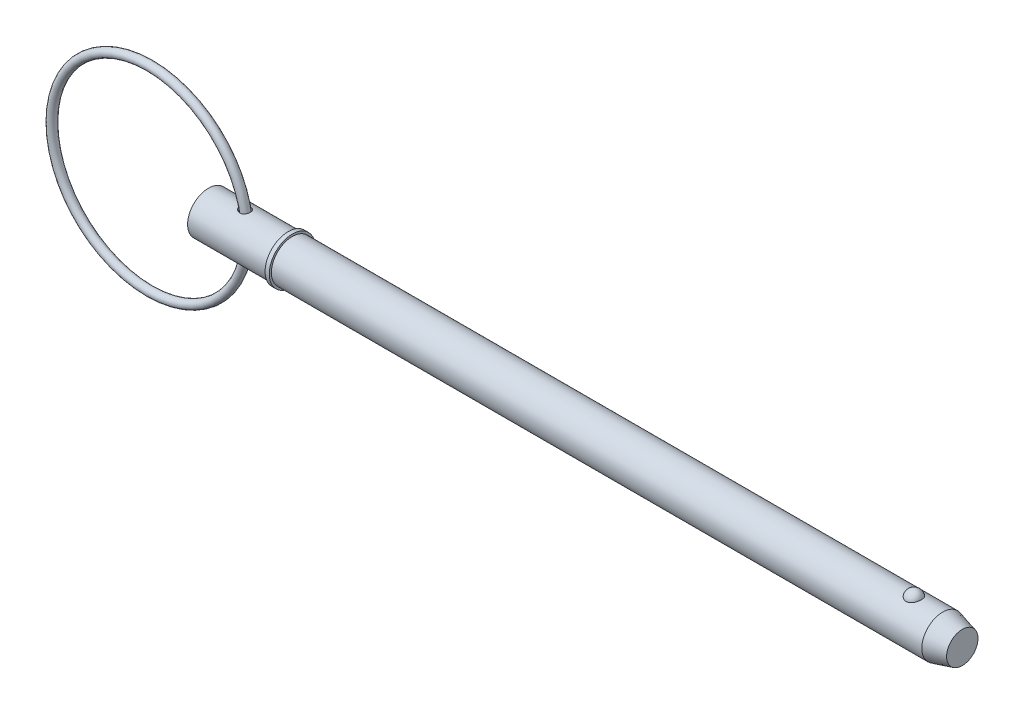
ISO-10303-21;
HEADER;
FILE_DESCRIPTION(('STEP AP214'),'2;1');
FILE_NAME('part.step','',(''),(''),'','','');
FILE_SCHEMA(('AUTOMOTIVE_DESIGN { 1 0 10303 214 1 1 1 1 }'));
ENDSEC;
DATA;
#1=APPLICATION_CONTEXT('core data for automotive mechanical design processes');
#2=APPLICATION_PROTOCOL_DEFINITION('international standard','automotive_design',2000,#1);
#3=PRODUCT_CONTEXT('',#1,'mechanical');
#4=PRODUCT('Part','Part','',(#3));
#5=PRODUCT_RELATED_PRODUCT_CATEGORY('part','',(#4));
#6=PRODUCT_DEFINITION_FORMATION('','',#4);
#7=PRODUCT_DEFINITION_CONTEXT('part definition',#1,'design');
#8=PRODUCT_DEFINITION('design','',#6,#7);
#9=PRODUCT_DEFINITION_SHAPE('','',#8);
#10=(LENGTH_UNIT() NAMED_UNIT(*) SI_UNIT(.MILLI.,.METRE.));
#11=(NAMED_UNIT(*) PLANE_ANGLE_UNIT() SI_UNIT($,.RADIAN.));
#12=(NAMED_UNIT(*) SI_UNIT($,.STERADIAN.) SOLID_ANGLE_UNIT());
#13=UNCERTAINTY_MEASURE_WITH_UNIT(LENGTH_MEASURE(1.E-05),#10,'distance_accuracy_value','');
#14=(GEOMETRIC_REPRESENTATION_CONTEXT(3) GLOBAL_UNCERTAINTY_ASSIGNED_CONTEXT((#13)) GLOBAL_UNIT_ASSIGNED_CONTEXT((#10,
#11,#12)) REPRESENTATION_CONTEXT('',''));
#15=CARTESIAN_POINT('',(0.,0.,0.));
#16=DIRECTION('',(0.,0.,1.));
#17=DIRECTION('',(1.,0.,0.));
#18=AXIS2_PLACEMENT_3D('',#15,#16,#17);
#19=CARTESIAN_POINT('',(-13.4013067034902,0.,0.));
#20=DIRECTION('',(0.,0.,1.));
#21=DIRECTION('',(1.,0.,0.));
#22=AXIS2_PLACEMENT_3D('',#19,#20,#21);
#23=TOROIDAL_SURFACE('',#22,22.225,0.952999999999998);
#24=CARTESIAN_POINT('',(9.77669329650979,0.,0.));
#25=VERTEX_POINT('',#24);
#26=VERTEX_LOOP('',#25);
#27=FACE_BOUND('',#26,.T.);
#28=ADVANCED_FACE('P0_F12',(#27),#23,.T.);
#29=CLOSED_SHELL('',(#28));
#30=MANIFOLD_SOLID_BREP('P0_B1',#29);
#31=CARTESIAN_POINT('',(0.,0.,0.));
#32=DIRECTION('',(1.,0.,0.));
#33=DIRECTION('',(0.,0.,-1.));
#34=AXIS2_PLACEMENT_3D('',#31,#32,#33);
#35=CYLINDRICAL_SURFACE('',#34,4.765);
#36=CARTESIAN_POINT('',(7.31773584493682,4.71580709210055,-0.682926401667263));
#37=CARTESIAN_POINT('',(7.3607471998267,4.70750812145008,-0.740230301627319));
#38=CARTESIAN_POINT('',(7.40883112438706,4.69869300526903,-0.79371122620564));
#39=CARTESIAN_POINT('',(7.51340999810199,4.68106981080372,-0.89180043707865));
#40=CARTESIAN_POINT('',(7.56991882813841,4.67226176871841,-0.936393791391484));
#41=CARTESIAN_POINT('',(7.689548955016,4.65568581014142,-1.01560363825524));
#42=CARTESIAN_POINT('',(7.75265928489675,4.64791621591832,-1.05023633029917));
#43=CARTESIAN_POINT('',(7.88387110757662,4.6343185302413,-1.10870278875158));
#44=CARTESIAN_POINT('',(7.95197058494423,4.62848966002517,-1.13254088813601));
#45=CARTESIAN_POINT('',(8.09209413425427,4.6194749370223,-1.16877415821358));
#46=CARTESIAN_POINT('',(8.16415141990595,4.6163169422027,-1.18104886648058));
#47=CARTESIAN_POINT('',(8.30937958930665,4.61324608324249,-1.19299123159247));
#48=CARTESIAN_POINT('',(8.38255011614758,4.61333220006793,-1.19266284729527));
#49=CARTESIAN_POINT('',(8.52374186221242,4.61674026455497,-1.17939593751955));
#50=CARTESIAN_POINT('',(8.59183022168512,4.61989017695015,-1.16712781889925));
#51=CARTESIAN_POINT('',(8.72470143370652,4.62884731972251,-1.13107903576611));
#52=CARTESIAN_POINT('',(8.78948513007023,4.63465386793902,-1.10730132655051));
#53=CARTESIAN_POINT('',(8.91088768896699,4.64792402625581,-1.05016249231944));
#54=CARTESIAN_POINT('',(8.96774302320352,4.65530108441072,-1.01728198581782));
#55=CARTESIAN_POINT('',(9.07499804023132,4.67102002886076,-0.942471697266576));
#56=CARTESIAN_POINT('',(9.12539777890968,4.6793619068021,-0.900541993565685));
#57=CARTESIAN_POINT('',(9.21836221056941,4.69607497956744,-0.808868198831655));
#58=CARTESIAN_POINT('',(9.26093651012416,4.70444612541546,-0.759133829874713));
#59=CARTESIAN_POINT('',(9.33728390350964,4.72032100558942,-0.653192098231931));
#60=CARTESIAN_POINT('',(9.3710564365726,4.72782468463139,-0.596984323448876));
#61=CARTESIAN_POINT('',(9.42940600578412,4.74126034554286,-0.478808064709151));
#62=CARTESIAN_POINT('',(9.45384681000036,4.74716869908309,-0.416769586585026));
#63=CARTESIAN_POINT('',(9.49226260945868,4.75663465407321,-0.289362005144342));
#64=CARTESIAN_POINT('',(9.50623742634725,4.76019221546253,-0.22399284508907));
#65=CARTESIAN_POINT('',(9.52342004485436,4.76458450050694,-0.0914886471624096));
#66=CARTESIAN_POINT('',(9.52658321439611,4.7654079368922,-0.0243474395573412));
#67=CARTESIAN_POINT('',(9.52194012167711,4.76421136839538,0.109528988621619));
#68=CARTESIAN_POINT('',(9.51413380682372,4.7621913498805,0.176264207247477));
#69=CARTESIAN_POINT('',(9.48775485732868,4.75552896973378,0.307367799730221));
#70=CARTESIAN_POINT('',(9.4691926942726,4.75088915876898,0.371738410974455));
#71=CARTESIAN_POINT('',(9.42175836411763,4.73949008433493,0.496364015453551));
#72=CARTESIAN_POINT('',(9.39288586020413,4.73273075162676,0.556618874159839));
#73=CARTESIAN_POINT('',(9.32549385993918,4.71782154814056,0.671371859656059));
#74=CARTESIAN_POINT('',(9.28696367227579,4.70967013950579,0.725863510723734));
#75=CARTESIAN_POINT('',(9.20123305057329,4.6928883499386,0.827453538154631));
#76=CARTESIAN_POINT('',(9.15403300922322,4.68425799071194,0.874552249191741));
#77=CARTESIAN_POINT('',(9.05250467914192,4.66754854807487,0.959736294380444));
#78=CARTESIAN_POINT('',(8.99822095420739,4.65946646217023,0.997874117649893));
#79=CARTESIAN_POINT('',(8.88381123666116,4.64472049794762,1.06440739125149));
#80=CARTESIAN_POINT('',(8.82368614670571,4.63805640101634,1.09280434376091));
#81=CARTESIAN_POINT('',(8.70022952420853,4.62698068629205,1.13878427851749));
#82=CARTESIAN_POINT('',(8.63695594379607,4.62253830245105,1.15651569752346));
#83=CARTESIAN_POINT('',(8.50825296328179,4.61622454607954,1.18146656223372));
#84=CARTESIAN_POINT('',(8.44282353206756,4.61435321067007,1.18868585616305));
#85=CARTESIAN_POINT('',(8.31119087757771,4.61332122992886,1.19268442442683));
#86=CARTESIAN_POINT('',(8.24498542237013,4.61417920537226,1.18939198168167));
#87=CARTESIAN_POINT('',(8.11397487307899,4.61847671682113,1.17259121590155));
#88=CARTESIAN_POINT('',(8.04917011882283,4.62191687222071,1.15908044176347));
#89=CARTESIAN_POINT('',(7.91946226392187,4.63117528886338,1.12153047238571));
#90=CARTESIAN_POINT('',(7.85470460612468,4.6371000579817,1.09701575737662));
#91=CARTESIAN_POINT('',(7.7300035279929,4.65063246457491,1.03814807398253));
#92=CARTESIAN_POINT('',(7.67006197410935,4.65824075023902,1.00379131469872));
#93=CARTESIAN_POINT('',(7.55352765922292,4.67473656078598,0.924015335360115));
#94=CARTESIAN_POINT('',(7.49726947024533,4.68366994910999,0.878115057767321));
#95=CARTESIAN_POINT('',(7.39344083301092,4.70144936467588,0.777311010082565));
#96=CARTESIAN_POINT('',(7.34587087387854,4.71029538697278,0.722406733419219));
#97=CARTESIAN_POINT('',(7.26188955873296,4.72669773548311,0.605773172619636));
#98=CARTESIAN_POINT('',(7.22531316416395,4.73427229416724,0.544165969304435));
#99=CARTESIAN_POINT('',(7.16406269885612,4.74732663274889,0.415095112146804));
#100=CARTESIAN_POINT('',(7.13937848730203,4.75280819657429,0.347636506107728));
#101=CARTESIAN_POINT('',(7.10494917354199,4.7605495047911,0.215359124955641));
#102=CARTESIAN_POINT('',(7.09405441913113,4.76305589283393,0.150853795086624));
#103=CARTESIAN_POINT('',(7.08387189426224,4.76539656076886,0.0208839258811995));
#104=CARTESIAN_POINT('',(7.0845805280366,4.76523166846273,-0.0445803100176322));
#105=CARTESIAN_POINT('',(7.09709111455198,4.76236014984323,-0.169693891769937));
#106=CARTESIAN_POINT('',(7.10810913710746,4.75983315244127,-0.229428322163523));
#107=CARTESIAN_POINT('',(7.13959099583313,4.75276726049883,-0.346187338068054));
#108=CARTESIAN_POINT('',(7.16004881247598,4.7482296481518,-0.403213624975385));
#109=CARTESIAN_POINT('',(7.20270325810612,4.73907067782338,-0.498040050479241));
#110=CARTESIAN_POINT('',(7.22286864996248,4.73481668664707,-0.536809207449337));
#111=CARTESIAN_POINT('',(7.26730952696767,4.72570777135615,-0.611832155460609));
#112=CARTESIAN_POINT('',(7.29158512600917,4.72085283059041,-0.64808587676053));
#113=CARTESIAN_POINT('',(7.31773584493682,4.71580709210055,-0.682926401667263));
#114=B_SPLINE_CURVE_WITH_KNOTS('',3,(#36,#37,#38,#39,#40,#41,#42,#43,#44,#45,#46,#47,#48,#49,
#50,#51,#52,#53,#54,#55,#56,#57,#58,#59,#60,#61,#62,#63,#64,#65,#66,#67,#68,#69,#70,#71,#72,#73,
#74,#75,#76,#77,#78,#79,#80,#81,#82,#83,#84,#85,#86,#87,#88,#89,#90,#91,#92,#93,#94,#95,#96,#97,
#98,#99,#100,#101,#102,#103,#104,#105,#106,#107,#108,#109,#110,#111,#112,#113),.UNSPECIFIED.,
.T.,.F.,(4,2,2,2,2,2,2,2,2,2,2,2,2,2,2,2,2,2,2,2,2,2,2,2,2,2,2,2,2,2,2,2,2,2,2,2,2,2,4),(0.,
0.216219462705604,0.432799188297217,0.649024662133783,0.865163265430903,1.08352938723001,
1.30182691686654,1.50853487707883,1.71518978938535,1.91252381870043,2.1098561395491,
2.30694457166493,2.50404555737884,2.70392296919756,2.90380378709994,3.10450875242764,
3.30521468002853,3.5057255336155,3.70624293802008,3.90698330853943,4.10771458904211,
4.30723900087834,4.50673262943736,4.70338139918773,4.90003300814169,5.09802914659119,
5.29607279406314,5.5036500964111,5.7113074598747,5.92972727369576,6.14815938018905,
6.36312650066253,6.57790998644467,6.77325899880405,6.96854747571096,7.15009726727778,
7.33153144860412,7.46298830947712,7.59444881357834),.UNSPECIFIED.);
#115=CARTESIAN_POINT('',(7.31773584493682,4.71580709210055,-0.682926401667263));
#116=VERTEX_POINT('',#115);
#117=EDGE_CURVE('P1_E42',#116,#116,#114,.T.);
#118=ORIENTED_EDGE('',*,*,#117,.T.);
#119=EDGE_LOOP('',(#118));
#120=FACE_BOUND('',#119,.T.);
#121=CARTESIAN_POINT('',(0.,0.,0.));
#122=DIRECTION('',(1.,0.,0.));
#123=DIRECTION('',(0.,0.,-1.));
#124=AXIS2_PLACEMENT_3D('',#121,#122,#123);
#125=CIRCLE('',#124,4.765);
#126=CARTESIAN_POINT('',(0.,0.,-4.765));
#127=VERTEX_POINT('',#126);
#128=EDGE_CURVE('P1_E9',#127,#127,#125,.T.);
#129=ORIENTED_EDGE('',*,*,#128,.T.);
#130=EDGE_LOOP('',(#129));
#131=FACE_BOUND('',#130,.T.);
#132=CARTESIAN_POINT('',(18.097,0.,0.));
#133=DIRECTION('',(1.,0.,0.));
#134=DIRECTION('',(0.,0.,-1.));
#135=AXIS2_PLACEMENT_3D('',#132,#133,#134);
#136=CIRCLE('',#135,4.765);
#137=CARTESIAN_POINT('',(18.097,0.,-4.765));
#138=VERTEX_POINT('',#137);
#139=EDGE_CURVE('P1_E25',#138,#138,#136,.T.);
#140=ORIENTED_EDGE('',*,*,#139,.F.);
#141=EDGE_LOOP('',(#140));
#142=FACE_BOUND('',#141,.T.);
#143=CARTESIAN_POINT('',(7.31773584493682,-4.71580709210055,-0.682926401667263));
#144=CARTESIAN_POINT('',(7.27956054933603,-4.72317282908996,-0.63206220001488));
#145=CARTESIAN_POINT('',(7.24535712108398,-4.7301361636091,-0.578155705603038));
#146=CARTESIAN_POINT('',(7.18611785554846,-4.74256090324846,-0.465352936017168));
#147=CARTESIAN_POINT('',(7.16107836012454,-4.74802290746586,-0.406458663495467));
#148=CARTESIAN_POINT('',(7.12119149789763,-4.75686558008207,-0.284913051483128));
#149=CARTESIAN_POINT('',(7.1063796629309,-4.76023898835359,-0.222249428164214));
#150=CARTESIAN_POINT('',(7.08786546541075,-4.76447177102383,-0.0952170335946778));
#151=CARTESIAN_POINT('',(7.08416018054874,-4.76533180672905,-0.0308487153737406));
#152=CARTESIAN_POINT('',(7.08795686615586,-4.76445764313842,0.0942755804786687));
#153=CARTESIAN_POINT('',(7.09490366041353,-4.762851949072,0.155050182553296));
#154=CARTESIAN_POINT('',(7.11863973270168,-4.75746086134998,0.2745356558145));
#155=CARTESIAN_POINT('',(7.13542953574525,-4.75367535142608,0.333246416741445));
#156=CARTESIAN_POINT('',(7.17817193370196,-4.74430545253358,0.447305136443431));
#157=CARTESIAN_POINT('',(7.20415836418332,-4.73871442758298,0.502639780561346));
#158=CARTESIAN_POINT('',(7.26428068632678,-4.72628508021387,0.608523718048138));
#159=CARTESIAN_POINT('',(7.29841897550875,-4.71944639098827,0.659071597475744));
#160=CARTESIAN_POINT('',(7.37680984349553,-4.70456239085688,0.758311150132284));
#161=CARTESIAN_POINT('',(7.42165519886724,-4.69646426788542,0.806526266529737));
#162=CARTESIAN_POINT('',(7.51828933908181,-4.68032890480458,0.895428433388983));
#163=CARTESIAN_POINT('',(7.57008134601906,-4.67229169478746,0.936111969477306));
#164=CARTESIAN_POINT('',(7.68397204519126,-4.65640659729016,1.01229731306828));
#165=CARTESIAN_POINT('',(7.74657226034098,-4.64863251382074,1.04706751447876));
#166=CARTESIAN_POINT('',(7.87680110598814,-4.6349740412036,1.10596507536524));
#167=CARTESIAN_POINT('',(7.94443054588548,-4.62908995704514,1.13009071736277));
#168=CARTESIAN_POINT('',(8.08402017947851,-4.61989019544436,1.16713943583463));
#169=CARTESIAN_POINT('',(8.15603143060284,-4.61661596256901,1.17988211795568));
#170=CARTESIAN_POINT('',(8.30124697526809,-4.61330446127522,1.1927680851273));
#171=CARTESIAN_POINT('',(8.37445077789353,-4.61326589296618,1.19291642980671));
#172=CARTESIAN_POINT('',(8.51584800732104,-4.61644036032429,1.18056687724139));
#173=CARTESIAN_POINT('',(8.58410302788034,-4.61948317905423,1.16873099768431));
#174=CARTESIAN_POINT('',(8.71738052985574,-4.6282520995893,1.13350536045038));
#175=CARTESIAN_POINT('',(8.78240382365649,-4.63397752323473,1.11011852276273));
#176=CARTESIAN_POINT('',(8.90428519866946,-4.64711877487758,1.05371003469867));
#177=CARTESIAN_POINT('',(8.96138096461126,-4.6544450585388,1.02117932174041));
#178=CARTESIAN_POINT('',(9.06916653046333,-4.6700970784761,0.947021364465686));
#179=CARTESIAN_POINT('',(9.11985639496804,-4.67842280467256,0.905394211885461));
#180=CARTESIAN_POINT('',(9.2134071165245,-4.69513303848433,0.814300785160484));
#181=CARTESIAN_POINT('',(9.25628268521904,-4.70351740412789,0.764849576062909));
#182=CARTESIAN_POINT('',(9.33327173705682,-4.71945185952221,0.659422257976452));
#183=CARTESIAN_POINT('',(9.3673846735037,-4.72700189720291,0.603445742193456));
#184=CARTESIAN_POINT('',(9.42645214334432,-4.74055953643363,0.485673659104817));
#185=CARTESIAN_POINT('',(9.45127042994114,-4.74654383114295,0.423807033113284));
#186=CARTESIAN_POINT('',(9.49046298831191,-4.756182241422,0.296676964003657));
#187=CARTESIAN_POINT('',(9.50483706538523,-4.75983631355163,0.231413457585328));
#188=CARTESIAN_POINT('',(9.52283408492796,-4.76443282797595,0.0990368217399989));
#189=CARTESIAN_POINT('',(9.52641016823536,-4.76536345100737,0.0319169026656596));
#190=CARTESIAN_POINT('',(9.52259067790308,-4.76437893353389,-0.101988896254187));
#191=CARTESIAN_POINT('',(9.5151950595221,-4.76246378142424,-0.168774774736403));
#192=CARTESIAN_POINT('',(9.48962516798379,-4.75599746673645,-0.300048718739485));
#193=CARTESIAN_POINT('',(9.4714615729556,-4.75144891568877,-0.364538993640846));
#194=CARTESIAN_POINT('',(9.42480303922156,-4.74020887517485,-0.489470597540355));
#195=CARTESIAN_POINT('',(9.396307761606,-4.73351731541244,-0.549911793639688));
#196=CARTESIAN_POINT('',(9.32963953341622,-4.71871240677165,-0.665099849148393));
#197=CARTESIAN_POINT('',(9.29145577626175,-4.71059747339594,-0.719840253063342));
#198=CARTESIAN_POINT('',(9.20637695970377,-4.69385254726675,-0.82198328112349));
#199=CARTESIAN_POINT('',(9.15948227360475,-4.68522257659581,-0.869386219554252));
#200=CARTESIAN_POINT('',(9.05849937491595,-4.66847516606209,-0.955233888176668));
#201=CARTESIAN_POINT('',(9.00445430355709,-4.6603550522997,-0.993728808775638));
#202=CARTESIAN_POINT('',(8.8904576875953,-4.64550122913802,-1.06100691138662));
#203=CARTESIAN_POINT('',(8.83050704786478,-4.63876730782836,-1.08979157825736));
#204=CARTESIAN_POINT('',(8.70732873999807,-4.6275305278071,-1.13655620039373));
#205=CARTESIAN_POINT('',(8.64416019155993,-4.62299714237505,-1.15468477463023));
#206=CARTESIAN_POINT('',(8.51559711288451,-4.61649071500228,-1.18043067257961));
#207=CARTESIAN_POINT('',(8.4502025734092,-4.61451768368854,-1.18804795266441));
#208=CARTESIAN_POINT('',(8.31862013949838,-4.61328355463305,-1.19283094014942));
#209=CARTESIAN_POINT('',(8.25242983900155,-4.61403911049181,-1.18993246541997));
#210=CARTESIAN_POINT('',(8.12138461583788,-4.61814057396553,-1.17391149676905));
#211=CARTESIAN_POINT('',(8.0565300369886,-4.62148714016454,-1.16078640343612));
#212=CARTESIAN_POINT('',(7.92669960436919,-4.63056912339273,-1.12402333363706));
#213=CARTESIAN_POINT('',(7.86186447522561,-4.63641051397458,-1.09991536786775));
#214=CARTESIAN_POINT('',(7.73694230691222,-4.64980121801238,-1.04185298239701));
#215=CARTESIAN_POINT('',(7.6768568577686,-4.65735110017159,-1.0078952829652));
#216=CARTESIAN_POINT('',(7.56207884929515,-4.67346080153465,-0.930364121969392));
#217=CARTESIAN_POINT('',(7.5074784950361,-4.68203382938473,-0.886656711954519));
#218=CARTESIAN_POINT('',(7.40624045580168,-4.69916824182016,-0.79082583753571));
#219=CARTESIAN_POINT('',(7.35959988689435,-4.7077296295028,-0.738705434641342));
#220=CARTESIAN_POINT('',(7.31773584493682,-4.71580709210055,-0.682926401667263));
#221=B_SPLINE_CURVE_WITH_KNOTS('',3,(#143,#144,#145,#146,#147,#148,#149,#150,#151,#152,#153,
#154,#155,#156,#157,#158,#159,#160,#161,#162,#163,#164,#165,#166,#167,#168,#169,#170,#171,#172,
#173,#174,#175,#176,#177,#178,#179,#180,#181,#182,#183,#184,#185,#186,#187,#188,#189,#190,#191,
#192,#193,#194,#195,#196,#197,#198,#199,#200,#201,#202,#203,#204,#205,#206,#207,#208,#209,#210,
#211,#212,#213,#214,#215,#216,#217,#218,#219,#220),.UNSPECIFIED.,.T.,.F.,(4,2,2,2,2,2,2,2,2,2,2,
2,2,2,2,2,2,2,2,2,2,2,2,2,2,2,2,2,2,2,2,2,2,2,2,2,2,2,4),(0.,0.191851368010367,0.38362606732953,
0.576063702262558,0.768450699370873,0.951145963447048,1.13385097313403,1.31723528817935,
1.50067360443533,1.69887079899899,1.8971602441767,2.11225870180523,2.32739185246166,
2.54587681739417,2.76427400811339,2.97123130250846,3.17813630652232,3.37555441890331,
3.57297054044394,3.77001106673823,3.96706388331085,4.16690159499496,4.36674303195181,
4.56745046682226,4.76815872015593,4.96866827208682,5.16918440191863,5.36992517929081,
5.5706573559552,5.77022940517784,5.96977092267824,6.16645904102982,6.36314797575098,
6.56103940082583,6.75898114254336,6.96633026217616,7.17374850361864,7.384214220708,
7.59460352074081),.UNSPECIFIED.);
#222=CARTESIAN_POINT('',(7.31773584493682,-4.71580709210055,-0.682926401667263));
#223=VERTEX_POINT('',#222);
#224=EDGE_CURVE('P1_E17',#223,#223,#221,.T.);
#225=ORIENTED_EDGE('',*,*,#224,.T.);
#226=EDGE_LOOP('',(#225));
#227=FACE_BOUND('',#226,.T.);
#228=ADVANCED_FACE('P1_F13',(#120,#131,#142,#227),#35,.T.);
#229=CARTESIAN_POINT('',(0.,0.,0.));
#230=DIRECTION('',(1.,0.,0.));
#231=DIRECTION('',(0.,0.,-1.));
#232=AXIS2_PLACEMENT_3D('',#229,#230,#231);
#233=CYLINDRICAL_SURFACE('',#232,4.765);
#234=CARTESIAN_POINT('',(167.004194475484,0.,0.));
#235=DIRECTION('',(1.,0.,0.));
#236=DIRECTION('',(0.,0.,-1.));
#237=AXIS2_PLACEMENT_3D('',#234,#235,#236);
#238=CIRCLE('',#237,4.765);
#239=CARTESIAN_POINT('',(167.004194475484,0.,-4.765));
#240=VERTEX_POINT('',#239);
#241=EDGE_CURVE('P1_E99',#240,#240,#238,.T.);
#242=ORIENTED_EDGE('',*,*,#241,.F.);
#243=EDGE_LOOP('',(#242));
#244=FACE_BOUND('',#243,.T.);
#245=CARTESIAN_POINT('',(19.05,0.,0.));
#246=DIRECTION('',(1.,0.,0.));
#247=DIRECTION('',(0.,0.,-1.));
#248=AXIS2_PLACEMENT_3D('',#245,#246,#247);
#249=CIRCLE('',#248,4.765);
#250=CARTESIAN_POINT('',(19.05,0.,-4.765));
#251=VERTEX_POINT('',#250);
#252=EDGE_CURVE('P1_E96',#251,#251,#249,.T.);
#253=ORIENTED_EDGE('',*,*,#252,.T.);
#254=EDGE_LOOP('',(#253));
#255=FACE_BOUND('',#254,.T.);
#256=CARTESIAN_POINT('',(160.451020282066,4.42764777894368,1.76101111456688));
#257=CARTESIAN_POINT('',(160.359721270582,4.42764470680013,1.76101422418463));
#258=CARTESIAN_POINT('',(160.268446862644,4.43059091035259,1.75366340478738));
#259=CARTESIAN_POINT('',(160.088615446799,4.44201846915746,1.72451180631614));
#260=CARTESIAN_POINT('',(160.000057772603,4.45049845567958,1.70271460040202));
#261=CARTESIAN_POINT('',(159.828257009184,4.47200516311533,1.64539370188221));
#262=CARTESIAN_POINT('',(159.745006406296,4.48502527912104,1.60988994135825));
#263=CARTESIAN_POINT('',(159.585763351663,4.51419542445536,1.52617873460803));
#264=CARTESIAN_POINT('',(159.509772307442,4.53034605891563,1.47796883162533));
#265=CARTESIAN_POINT('',(159.364744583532,4.56459317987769,1.36860494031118));
#266=CARTESIAN_POINT('',(159.295964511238,4.58273170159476,1.30712420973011));
#267=CARTESIAN_POINT('',(159.169342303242,4.61870302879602,1.17370204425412));
#268=CARTESIAN_POINT('',(159.111502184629,4.63653577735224,1.10175868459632));
#269=CARTESIAN_POINT('',(159.005570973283,4.67090140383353,0.945806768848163));
#270=CARTESIAN_POINT('',(158.958030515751,4.68734068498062,0.861402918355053));
#271=CARTESIAN_POINT('',(158.877081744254,4.71628466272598,0.68544236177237));
#272=CARTESIAN_POINT('',(158.843674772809,4.72878898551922,0.593884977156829));
#273=CARTESIAN_POINT('',(158.791287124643,4.74874061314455,0.404781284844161));
#274=CARTESIAN_POINT('',(158.772517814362,4.75611366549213,0.307168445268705));
#275=CARTESIAN_POINT('',(158.750584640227,4.76475393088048,0.109940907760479));
#276=CARTESIAN_POINT('',(158.747420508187,4.76602124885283,0.0103262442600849));
#277=CARTESIAN_POINT('',(158.756740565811,4.76232928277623,-0.187629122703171));
#278=CARTESIAN_POINT('',(158.769158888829,4.7573962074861,-0.285973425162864));
#279=CARTESIAN_POINT('',(158.809280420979,4.74184975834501,-0.479027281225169));
#280=CARTESIAN_POINT('',(158.836983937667,4.7312362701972,-0.573736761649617));
#281=CARTESIAN_POINT('',(158.907158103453,4.70540026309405,-0.756973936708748));
#282=CARTESIAN_POINT('',(158.949646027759,4.69017235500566,-0.845494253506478));
#283=CARTESIAN_POINT('',(159.048520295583,4.65669867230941,-1.01378033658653));
#284=CARTESIAN_POINT('',(159.104907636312,4.63845268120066,-1.09354547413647));
#285=CARTESIAN_POINT('',(159.230552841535,4.60085438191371,-1.24228523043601));
#286=CARTESIAN_POINT('',(159.299843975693,4.58149930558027,-1.31123108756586));
#287=CARTESIAN_POINT('',(159.449606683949,4.54391653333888,-1.43607409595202));
#288=CARTESIAN_POINT('',(159.530077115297,4.52568872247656,-1.49197257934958));
#289=CARTESIAN_POINT('',(159.698150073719,4.49293007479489,-1.58786764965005));
#290=CARTESIAN_POINT('',(159.785544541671,4.47832346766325,-1.62820219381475));
#291=CARTESIAN_POINT('',(159.966553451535,4.45406011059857,-1.69345757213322));
#292=CARTESIAN_POINT('',(160.06016555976,4.44440151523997,-1.71838415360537));
#293=CARTESIAN_POINT('',(160.245893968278,4.43159888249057,-1.75112843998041));
#294=CARTESIAN_POINT('',(160.337849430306,4.42815213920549,-1.75974223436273));
#295=CARTESIAN_POINT('',(160.521965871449,4.427247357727,-1.76201865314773));
#296=CARTESIAN_POINT('',(160.614126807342,4.42978816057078,-1.7556841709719));
#297=CARTESIAN_POINT('',(160.793129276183,4.44038648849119,-1.72869560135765));
#298=CARTESIAN_POINT('',(160.880047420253,4.44827555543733,-1.70847853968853));
#299=CARTESIAN_POINT('',(161.049131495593,4.46852246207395,-1.65479562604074));
#300=CARTESIAN_POINT('',(161.131297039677,4.48088066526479,-1.62132869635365));
#301=CARTESIAN_POINT('',(161.290591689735,4.50907357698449,-1.54120560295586));
#302=CARTESIAN_POINT('',(161.367570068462,4.52497884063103,-1.49427526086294));
#303=CARTESIAN_POINT('',(161.512708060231,4.55845148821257,-1.38881222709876));
#304=CARTESIAN_POINT('',(161.580865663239,4.57601924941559,-1.33027689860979));
#305=CARTESIAN_POINT('',(161.710099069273,4.61196537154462,-1.1999104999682));
#306=CARTESIAN_POINT('',(161.770656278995,4.63034074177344,-1.12756415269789));
#307=CARTESIAN_POINT('',(161.879279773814,4.66513959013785,-0.97361299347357));
#308=CARTESIAN_POINT('',(161.927343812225,4.68156271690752,-0.892006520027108));
#309=CARTESIAN_POINT('',(162.011383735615,4.71130224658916,-0.718892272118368));
#310=CARTESIAN_POINT('',(162.046918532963,4.724501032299,-0.627149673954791));
#311=CARTESIAN_POINT('',(162.102952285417,4.74571823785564,-0.438611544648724));
#312=CARTESIAN_POINT('',(162.123450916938,4.75373654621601,-0.34181590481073));
#313=CARTESIAN_POINT('',(162.149033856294,4.76378905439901,-0.14563306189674));
#314=CARTESIAN_POINT('',(162.154076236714,4.76580697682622,-0.046239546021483));
#315=CARTESIAN_POINT('',(162.148523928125,4.7636057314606,0.152038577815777));
#316=CARTESIAN_POINT('',(162.137929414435,4.75938663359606,0.250923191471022));
#317=CARTESIAN_POINT('',(162.101387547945,4.74516937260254,0.445004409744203));
#318=CARTESIAN_POINT('',(162.075496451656,4.73519238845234,0.540213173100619));
#319=CARTESIAN_POINT('',(162.008927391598,4.71049394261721,0.724662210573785));
#320=CARTESIAN_POINT('',(161.968248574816,4.69577220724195,0.813902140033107));
#321=CARTESIAN_POINT('',(161.872717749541,4.66303767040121,0.984313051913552));
#322=CARTESIAN_POINT('',(161.817804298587,4.64501070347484,1.06544688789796));
#323=CARTESIAN_POINT('',(161.695049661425,4.60764678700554,1.21692673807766));
#324=CARTESIAN_POINT('',(161.627208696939,4.58830985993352,1.28727293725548));
#325=CARTESIAN_POINT('',(161.480548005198,4.55060370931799,1.41479271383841));
#326=CARTESIAN_POINT('',(161.401791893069,4.53222967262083,1.47203785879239));
#327=CARTESIAN_POINT('',(161.234989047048,4.49849576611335,1.57212016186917));
#328=CARTESIAN_POINT('',(161.146941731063,4.48313608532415,1.6149564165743));
#329=CARTESIAN_POINT('',(160.959791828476,4.45676184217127,1.68642657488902));
#330=CARTESIAN_POINT('',(160.860365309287,4.44598302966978,1.71430590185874));
#331=CARTESIAN_POINT('',(160.657621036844,4.43142918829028,1.7515925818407));
#332=CARTESIAN_POINT('',(160.554304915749,4.42765125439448,1.76100759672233));
#333=CARTESIAN_POINT('',(160.451020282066,4.42764777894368,1.76101111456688));
#334=B_SPLINE_CURVE_WITH_KNOTS('',3,(#256,#257,#258,#259,#260,#261,#262,#263,#264,#265,#266,
#267,#268,#269,#270,#271,#272,#273,#274,#275,#276,#277,#278,#279,#280,#281,#282,#283,#284,#285,
#286,#287,#288,#289,#290,#291,#292,#293,#294,#295,#296,#297,#298,#299,#300,#301,#302,#303,#304,
#305,#306,#307,#308,#309,#310,#311,#312,#313,#314,#315,#316,#317,#318,#319,#320,#321,#322,#323,
#324,#325,#326,#327,#328,#329,#330,#331,#332,#333),.UNSPECIFIED.,.T.,.F.,(4,2,2,2,2,2,2,2,2,2,2,
2,2,2,2,2,2,2,2,2,2,2,2,2,2,2,2,2,2,2,2,2,2,2,2,2,2,2,4),(0.,0.273517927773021,
0.546968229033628,0.820022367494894,1.09312934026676,1.37393946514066,1.6548013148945,
1.94820420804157,2.24163496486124,2.53922817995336,2.83681628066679,3.13315071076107,
3.42949110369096,3.72617893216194,4.02288805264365,4.32037303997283,4.61782764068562,
4.90840095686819,5.19886582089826,5.47474855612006,5.75057789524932,6.0180997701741,
6.28564340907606,6.55907787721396,6.83257454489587,7.11962987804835,7.40673679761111,
7.70312663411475,7.9995228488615,8.29672237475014,8.59391856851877,8.89002850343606,
9.18615552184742,9.48358266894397,9.7810047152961,10.0767610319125,10.3725358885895,
10.6820893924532,10.991514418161),.UNSPECIFIED.);
#335=CARTESIAN_POINT('',(160.451020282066,4.42764777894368,1.76101111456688));
#336=VERTEX_POINT('',#335);
#337=EDGE_CURVE('P1_E34',#336,#336,#334,.T.);
#338=ORIENTED_EDGE('',*,*,#337,.T.);
#339=EDGE_LOOP('',(#338));
#340=FACE_BOUND('',#339,.T.);
#341=ADVANCED_FACE('P1_F46',(#244,#255,#340),#233,.T.);
#342=CARTESIAN_POINT('',(0.,0.,0.));
#343=DIRECTION('',(-1.,0.,0.));
#344=DIRECTION('',(0.,0.,1.));
#345=AXIS2_PLACEMENT_3D('',#342,#343,#344);
#346=PLANE('',#345);
#347=ORIENTED_EDGE('',*,*,#128,.F.);
#348=EDGE_LOOP('',(#347));
#349=FACE_BOUND('',#348,.T.);
#350=ADVANCED_FACE('P1_F15',(#349),#346,.T.);
#351=CARTESIAN_POINT('',(18.097,4.765,0.));
#352=DIRECTION('',(-1.,0.,0.));
#353=DIRECTION('',(0.,0.,1.));
#354=AXIS2_PLACEMENT_3D('',#351,#352,#353);
#355=PLANE('',#354);
#356=ORIENTED_EDGE('',*,*,#139,.T.);
#357=EDGE_LOOP('',(#356));
#358=FACE_BOUND('',#357,.T.);
#359=CARTESIAN_POINT('',(18.097,0.,0.));
#360=DIRECTION('',(1.,0.,0.));
#361=DIRECTION('',(0.,0.,-1.));
#362=AXIS2_PLACEMENT_3D('',#359,#360,#361);
#363=CIRCLE('',#362,5.2415);
#364=CARTESIAN_POINT('',(18.097,0.,-5.2415));
#365=VERTEX_POINT('',#364);
#366=EDGE_CURVE('P1_E30',#365,#365,#363,.T.);
#367=ORIENTED_EDGE('',*,*,#366,.F.);
#368=EDGE_LOOP('',(#367));
#369=FACE_BOUND('',#368,.T.);
#370=ADVANCED_FACE('P1_F81',(#358,#369),#355,.T.);
#371=CARTESIAN_POINT('',(0.,0.,0.));
#372=DIRECTION('',(1.,0.,0.));
#373=DIRECTION('',(0.,0.,-1.));
#374=AXIS2_PLACEMENT_3D('',#371,#372,#373);
#375=CYLINDRICAL_SURFACE('',#374,5.2415);
#376=ORIENTED_EDGE('',*,*,#366,.T.);
#377=EDGE_LOOP('',(#376));
#378=FACE_BOUND('',#377,.T.);
#379=CARTESIAN_POINT('',(19.05,0.,0.));
#380=DIRECTION('',(1.,0.,0.));
#381=DIRECTION('',(0.,0.,-1.));
#382=AXIS2_PLACEMENT_3D('',#379,#380,#381);
#383=CIRCLE('',#382,5.2415);
#384=CARTESIAN_POINT('',(19.05,0.,-5.2415));
#385=VERTEX_POINT('',#384);
#386=EDGE_CURVE('P1_E95',#385,#385,#383,.T.);
#387=ORIENTED_EDGE('',*,*,#386,.F.);
#388=EDGE_LOOP('',(#387));
#389=FACE_BOUND('',#388,.T.);
#390=ADVANCED_FACE('P1_F68',(#378,#389),#375,.T.);
#391=CARTESIAN_POINT('',(19.05,5.2415,0.));
#392=DIRECTION('',(1.,0.,0.));
#393=DIRECTION('',(0.,0.,-1.));
#394=AXIS2_PLACEMENT_3D('',#391,#392,#393);
#395=PLANE('',#394);
#396=ORIENTED_EDGE('',*,*,#386,.T.);
#397=EDGE_LOOP('',(#396));
#398=FACE_BOUND('',#397,.T.);
#399=ORIENTED_EDGE('',*,*,#252,.F.);
#400=EDGE_LOOP('',(#399));
#401=FACE_BOUND('',#400,.T.);
#402=ADVANCED_FACE('P1_F62',(#398,#401),#395,.T.);
#403=CARTESIAN_POINT('',(171.45,0.,0.));
#404=DIRECTION('',(-1.,0.,0.));
#405=DIRECTION('',(0.,0.,1.));
#406=AXIS2_PLACEMENT_3D('',#403,#404,#405);
#407=CONICAL_SURFACE('',#406,3.57375000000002,0.26179938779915);
#408=ORIENTED_EDGE('',*,*,#241,.T.);
#409=EDGE_LOOP('',(#408));
#410=FACE_BOUND('',#409,.T.);
#411=CARTESIAN_POINT('',(171.45,0.,0.));
#412=DIRECTION('',(1.,0.,0.));
#413=DIRECTION('',(0.,0.,-1.));
#414=AXIS2_PLACEMENT_3D('',#411,#412,#413);
#415=CIRCLE('',#414,3.57375000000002);
#416=CARTESIAN_POINT('',(171.45,0.,-3.57375000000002));
#417=VERTEX_POINT('',#416);
#418=EDGE_CURVE('P1_E41',#417,#417,#415,.T.);
#419=ORIENTED_EDGE('',*,*,#418,.F.);
#420=EDGE_LOOP('',(#419));
#421=FACE_BOUND('',#420,.T.);
#422=ADVANCED_FACE('P1_F59',(#410,#421),#407,.T.);
#423=CARTESIAN_POINT('',(171.45,3.57375000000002,0.));
#424=DIRECTION('',(1.,0.,0.));
#425=DIRECTION('',(0.,0.,-1.));
#426=AXIS2_PLACEMENT_3D('',#423,#424,#425);
#427=PLANE('',#426);
#428=ORIENTED_EDGE('',*,*,#418,.T.);
#429=EDGE_LOOP('',(#428));
#430=FACE_BOUND('',#429,.T.);
#431=ADVANCED_FACE('P1_F55',(#430),#427,.T.);
#432=CARTESIAN_POINT('',(160.451020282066,4.2885,0.));
#433=DIRECTION('',(-1.,0.,0.));
#434=DIRECTION('',(0.,-1.,0.));
#435=AXIS2_PLACEMENT_3D('',#432,#433,#434);
#436=SPHERICAL_SURFACE('',#435,1.7665);
#437=ORIENTED_EDGE('',*,*,#337,.F.);
#438=EDGE_LOOP('',(#437));
#439=FACE_BOUND('',#438,.T.);
#440=ADVANCED_FACE('P1_F50',(#439),#436,.T.);
#441=CARTESIAN_POINT('',(-13.4013067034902,0.,0.));
#442=DIRECTION('',(0.,0.,1.));
#443=DIRECTION('',(1.,0.,0.));
#444=AXIS2_PLACEMENT_3D('',#441,#442,#443);
#445=TOROIDAL_SURFACE('',#444,22.225,1.19125);
#446=ORIENTED_EDGE('',*,*,#224,.F.);
#447=EDGE_LOOP('',(#446));
#448=FACE_BOUND('',#447,.T.);
#449=ORIENTED_EDGE('',*,*,#117,.F.);
#450=EDGE_LOOP('',(#449));
#451=FACE_BOUND('',#450,.T.);
#452=ADVANCED_FACE('P1_F54',(#448,#451),#445,.F.);
#453=CLOSED_SHELL('',(#228,#341,#350,#370,#390,#402,#422,#431,#440,#452));
#454=MANIFOLD_SOLID_BREP('P1_B1',#453);
#455=ADVANCED_BREP_SHAPE_REPRESENTATION('',(#18,#30,#454),#14);
#456=SHAPE_DEFINITION_REPRESENTATION(#9,#455);
ENDSEC;
END-ISO-10303-21;
